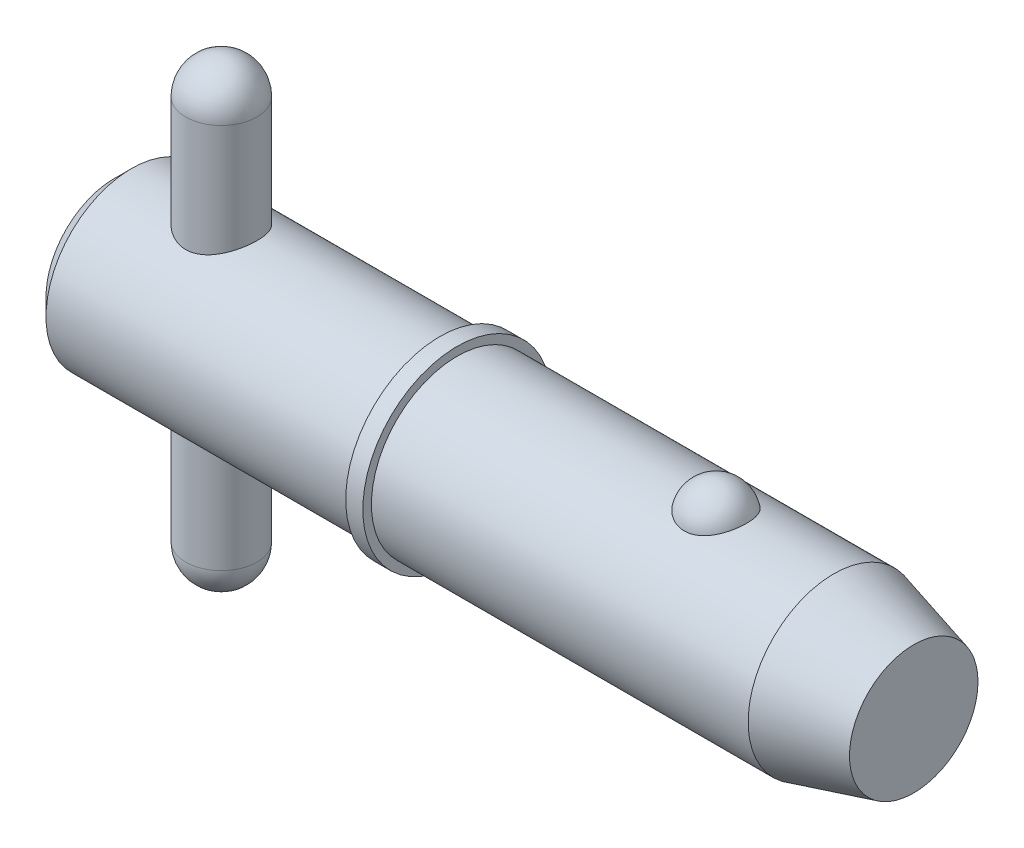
ISO-10303-21;
HEADER;
FILE_DESCRIPTION(('STEP AP214'),'2;1');
FILE_NAME('part.step','',(''),(''),'','','');
FILE_SCHEMA(('AUTOMOTIVE_DESIGN { 1 0 10303 214 1 1 1 1 }'));
ENDSEC;
DATA;
#1=APPLICATION_CONTEXT('core data for automotive mechanical design processes');
#2=APPLICATION_PROTOCOL_DEFINITION('international standard','automotive_design',2000,#1);
#3=PRODUCT_CONTEXT('',#1,'mechanical');
#4=PRODUCT('Part','Part','',(#3));
#5=PRODUCT_RELATED_PRODUCT_CATEGORY('part','',(#4));
#6=PRODUCT_DEFINITION_FORMATION('','',#4);
#7=PRODUCT_DEFINITION_CONTEXT('part definition',#1,'design');
#8=PRODUCT_DEFINITION('design','',#6,#7);
#9=PRODUCT_DEFINITION_SHAPE('','',#8);
#10=(LENGTH_UNIT() NAMED_UNIT(*) SI_UNIT(.MILLI.,.METRE.));
#11=(NAMED_UNIT(*) PLANE_ANGLE_UNIT() SI_UNIT($,.RADIAN.));
#12=(NAMED_UNIT(*) SI_UNIT($,.STERADIAN.) SOLID_ANGLE_UNIT());
#13=UNCERTAINTY_MEASURE_WITH_UNIT(LENGTH_MEASURE(1.E-05),#10,'distance_accuracy_value','');
#14=(GEOMETRIC_REPRESENTATION_CONTEXT(3) GLOBAL_UNCERTAINTY_ASSIGNED_CONTEXT((#13)) GLOBAL_UNIT_ASSIGNED_CONTEXT((#10,
#11,#12)) REPRESENTATION_CONTEXT('',''));
#15=CARTESIAN_POINT('',(0.,0.,0.));
#16=DIRECTION('',(0.,0.,1.));
#17=DIRECTION('',(1.,0.,0.));
#18=AXIS2_PLACEMENT_3D('',#15,#16,#17);
#19=CARTESIAN_POINT('',(5.94,12.7,0.));
#20=DIRECTION('',(0.,-1.,0.));
#21=DIRECTION('',(0.,0.,-1.));
#22=AXIS2_PLACEMENT_3D('',#19,#20,#21);
#23=CYLINDRICAL_SURFACE('',#22,1.98);
#24=CARTESIAN_POINT('',(5.94,-10.72,0.));
#25=DIRECTION('',(0.,-1.,0.));
#26=DIRECTION('',(0.,0.,-1.));
#27=AXIS2_PLACEMENT_3D('',#24,#25,#26);
#28=CIRCLE('',#27,1.98);
#29=CARTESIAN_POINT('',(5.94,-10.72,-1.98));
#30=VERTEX_POINT('',#29);
#31=EDGE_CURVE('P0_E10',#30,#30,#28,.F.);
#32=ORIENTED_EDGE('',*,*,#31,.T.);
#33=EDGE_LOOP('',(#32));
#34=FACE_BOUND('',#33,.T.);
#35=CARTESIAN_POINT('',(5.94,10.72,0.));
#36=DIRECTION('',(0.,-1.,0.));
#37=DIRECTION('',(0.,0.,-1.));
#38=AXIS2_PLACEMENT_3D('',#35,#36,#37);
#39=CIRCLE('',#38,1.98);
#40=CARTESIAN_POINT('',(5.94,10.72,-1.98));
#41=VERTEX_POINT('',#40);
#42=EDGE_CURVE('P0_E21',#41,#41,#39,.T.);
#43=ORIENTED_EDGE('',*,*,#42,.T.);
#44=EDGE_LOOP('',(#43));
#45=FACE_BOUND('',#44,.T.);
#46=ADVANCED_FACE('P0_F14',(#34,#45),#23,.T.);
#47=CARTESIAN_POINT('',(5.94,-10.72,0.));
#48=DIRECTION('',(0.,0.,1.));
#49=DIRECTION('',(1.,0.,0.));
#50=AXIS2_PLACEMENT_3D('',#47,#48,#49);
#51=SPHERICAL_SURFACE('',#50,1.98);
#52=CARTESIAN_POINT('',(5.94,-10.72,0.));
#53=DIRECTION('',(0.,-1.,0.));
#54=DIRECTION('',(0.,0.,-1.));
#55=AXIS2_PLACEMENT_3D('',#52,#53,#54);
#56=SPHERICAL_SURFACE('',#55,1.98);
#57=ORIENTED_EDGE('',*,*,#31,.F.);
#58=EDGE_LOOP('',(#57));
#59=FACE_BOUND('',#58,.T.);
#60=ADVANCED_FACE('P0_F29',(#59),#56,.T.);
#61=CARTESIAN_POINT('',(5.94,10.72,0.));
#62=DIRECTION('',(0.,0.,1.));
#63=DIRECTION('',(1.,0.,0.));
#64=AXIS2_PLACEMENT_3D('',#61,#62,#63);
#65=SPHERICAL_SURFACE('',#64,1.98);
#66=CARTESIAN_POINT('',(5.94,10.72,0.));
#67=DIRECTION('',(0.,-1.,0.));
#68=DIRECTION('',(0.,0.,-1.));
#69=AXIS2_PLACEMENT_3D('',#66,#67,#68);
#70=SPHERICAL_SURFACE('',#69,1.98);
#71=ORIENTED_EDGE('',*,*,#42,.F.);
#72=EDGE_LOOP('',(#71));
#73=FACE_BOUND('',#72,.T.);
#74=ADVANCED_FACE('P0_F16',(#73),#70,.T.);
#75=CLOSED_SHELL('',(#46,#60,#74));
#76=MANIFOLD_SOLID_BREP('P0_B1',#75);
#77=CARTESIAN_POINT('',(0.,0.,0.));
#78=DIRECTION('',(1.,0.,0.));
#79=DIRECTION('',(0.,0.,-1.));
#80=AXIS2_PLACEMENT_3D('',#77,#78,#79);
#81=CYLINDRICAL_SURFACE('',#80,4.765);
#82=CARTESIAN_POINT('',(40.0041944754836,0.,0.));
#83=DIRECTION('',(1.,0.,0.));
#84=DIRECTION('',(0.,0.,-1.));
#85=AXIS2_PLACEMENT_3D('',#82,#83,#84);
#86=CIRCLE('',#85,4.765);
#87=CARTESIAN_POINT('',(40.0041944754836,0.,-4.765));
#88=VERTEX_POINT('',#87);
#89=EDGE_CURVE('P1_E81',#88,#88,#86,.T.);
#90=ORIENTED_EDGE('',*,*,#89,.F.);
#91=EDGE_LOOP('',(#90));
#92=FACE_BOUND('',#91,.T.);
#93=CARTESIAN_POINT('',(19.05,0.,0.));
#94=DIRECTION('',(1.,0.,0.));
#95=DIRECTION('',(0.,0.,-1.));
#96=AXIS2_PLACEMENT_3D('',#93,#94,#95);
#97=CIRCLE('',#96,4.765);
#98=CARTESIAN_POINT('',(19.05,0.,-4.765));
#99=VERTEX_POINT('',#98);
#100=EDGE_CURVE('P1_E85',#99,#99,#97,.T.);
#101=ORIENTED_EDGE('',*,*,#100,.T.);
#102=EDGE_LOOP('',(#101));
#103=FACE_BOUND('',#102,.T.);
#104=CARTESIAN_POINT('',(33.451020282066,4.42764777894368,1.76101111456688));
#105=CARTESIAN_POINT('',(33.3597212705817,4.42764470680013,1.76101422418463));
#106=CARTESIAN_POINT('',(33.2684468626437,4.43059091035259,1.75366340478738));
#107=CARTESIAN_POINT('',(33.0886154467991,4.44201846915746,1.72451180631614));
#108=CARTESIAN_POINT('',(33.0000577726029,4.45049845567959,1.70271460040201));
#109=CARTESIAN_POINT('',(32.8282570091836,4.47200516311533,1.64539370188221));
#110=CARTESIAN_POINT('',(32.7450064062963,4.48502527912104,1.60988994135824));
#111=CARTESIAN_POINT('',(32.5857633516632,4.51419542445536,1.52617873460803));
#112=CARTESIAN_POINT('',(32.5097723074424,4.53034605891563,1.47796883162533));
#113=CARTESIAN_POINT('',(32.3647445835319,4.5645931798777,1.36860494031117));
#114=CARTESIAN_POINT('',(32.2959645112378,4.58273170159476,1.3071242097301));
#115=CARTESIAN_POINT('',(32.1693423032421,4.61870302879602,1.17370204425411));
#116=CARTESIAN_POINT('',(32.1115021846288,4.63653577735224,1.10175868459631));
#117=CARTESIAN_POINT('',(32.0055709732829,4.67090140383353,0.945806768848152));
#118=CARTESIAN_POINT('',(31.9580305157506,4.68734068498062,0.861402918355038));
#119=CARTESIAN_POINT('',(31.8770817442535,4.71628466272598,0.685442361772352));
#120=CARTESIAN_POINT('',(31.8436747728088,4.72878898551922,0.593884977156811));
#121=CARTESIAN_POINT('',(31.791287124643,4.74874061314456,0.404781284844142));
#122=CARTESIAN_POINT('',(31.7725178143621,4.75611366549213,0.307168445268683));
#123=CARTESIAN_POINT('',(31.7505846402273,4.76475393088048,0.109940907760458));
#124=CARTESIAN_POINT('',(31.7474205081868,4.76602124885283,0.0103262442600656));
#125=CARTESIAN_POINT('',(31.7567405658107,4.76232928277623,-0.187629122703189));
#126=CARTESIAN_POINT('',(31.7691588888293,4.7573962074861,-0.285973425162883));
#127=CARTESIAN_POINT('',(31.8092804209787,4.74184975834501,-0.479027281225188));
#128=CARTESIAN_POINT('',(31.8369839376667,4.7312362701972,-0.573736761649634));
#129=CARTESIAN_POINT('',(31.9071581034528,4.70540026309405,-0.756973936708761));
#130=CARTESIAN_POINT('',(31.9496460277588,4.69017235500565,-0.845494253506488));
#131=CARTESIAN_POINT('',(32.048520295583,4.6566986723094,-1.01378033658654));
#132=CARTESIAN_POINT('',(32.1049076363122,4.63845268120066,-1.09354547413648));
#133=CARTESIAN_POINT('',(32.230552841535,4.60085438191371,-1.24228523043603));
#134=CARTESIAN_POINT('',(32.2998439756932,4.58149930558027,-1.31123108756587));
#135=CARTESIAN_POINT('',(32.4496066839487,4.54391653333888,-1.43607409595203));
#136=CARTESIAN_POINT('',(32.5300771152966,4.52568872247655,-1.49197257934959));
#137=CARTESIAN_POINT('',(32.6981500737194,4.49293007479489,-1.58786764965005));
#138=CARTESIAN_POINT('',(32.7855445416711,4.47832346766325,-1.62820219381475));
#139=CARTESIAN_POINT('',(32.966553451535,4.45406011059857,-1.69345757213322));
#140=CARTESIAN_POINT('',(33.0601655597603,4.44440151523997,-1.71838415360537));
#141=CARTESIAN_POINT('',(33.2458939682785,4.43159888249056,-1.75112843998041));
#142=CARTESIAN_POINT('',(33.337849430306,4.42815213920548,-1.75974223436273));
#143=CARTESIAN_POINT('',(33.5219658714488,4.427247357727,-1.76201865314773));
#144=CARTESIAN_POINT('',(33.6141268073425,4.42978816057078,-1.7556841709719));
#145=CARTESIAN_POINT('',(33.7931292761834,4.4403864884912,-1.72869560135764));
#146=CARTESIAN_POINT('',(33.8800474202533,4.44827555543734,-1.70847853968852));
#147=CARTESIAN_POINT('',(34.0491314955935,4.46852246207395,-1.65479562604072));
#148=CARTESIAN_POINT('',(34.1312970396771,4.48088066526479,-1.62132869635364));
#149=CARTESIAN_POINT('',(34.2905916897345,4.50907357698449,-1.54120560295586));
#150=CARTESIAN_POINT('',(34.3675700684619,4.52497884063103,-1.49427526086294));
#151=CARTESIAN_POINT('',(34.5127080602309,4.55845148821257,-1.38881222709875));
#152=CARTESIAN_POINT('',(34.5808656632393,4.57601924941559,-1.33027689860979));
#153=CARTESIAN_POINT('',(34.7100990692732,4.61196537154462,-1.19991049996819));
#154=CARTESIAN_POINT('',(34.7706562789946,4.63034074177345,-1.12756415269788));
#155=CARTESIAN_POINT('',(34.8792797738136,4.66513959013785,-0.973612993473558));
#156=CARTESIAN_POINT('',(34.9273438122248,4.68156271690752,-0.892006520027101));
#157=CARTESIAN_POINT('',(35.011383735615,4.71130224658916,-0.718892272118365));
#158=CARTESIAN_POINT('',(35.0469185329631,4.724501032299,-0.627149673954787));
#159=CARTESIAN_POINT('',(35.1029522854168,4.74571823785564,-0.438611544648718));
#160=CARTESIAN_POINT('',(35.123450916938,4.75373654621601,-0.341815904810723));
#161=CARTESIAN_POINT('',(35.1490338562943,4.76378905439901,-0.145633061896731));
#162=CARTESIAN_POINT('',(35.154076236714,4.76580697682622,-0.046239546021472));
#163=CARTESIAN_POINT('',(35.1485239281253,4.76360573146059,0.15203857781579));
#164=CARTESIAN_POINT('',(35.1379294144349,4.75938663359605,0.250923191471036));
#165=CARTESIAN_POINT('',(35.1013875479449,4.74516937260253,0.445004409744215));
#166=CARTESIAN_POINT('',(35.0754964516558,4.73519238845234,0.540213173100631));
#167=CARTESIAN_POINT('',(35.0089273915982,4.7104939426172,0.724662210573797));
#168=CARTESIAN_POINT('',(34.968248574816,4.69577220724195,0.81390214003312));
#169=CARTESIAN_POINT('',(34.8727177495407,4.66303767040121,0.984313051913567));
#170=CARTESIAN_POINT('',(34.8178042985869,4.64501070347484,1.06544688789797));
#171=CARTESIAN_POINT('',(34.6950496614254,4.60764678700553,1.21692673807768));
#172=CARTESIAN_POINT('',(34.6272086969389,4.58830985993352,1.2872729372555));
#173=CARTESIAN_POINT('',(34.4805480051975,4.55060370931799,1.41479271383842));
#174=CARTESIAN_POINT('',(34.4017918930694,4.53222967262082,1.47203785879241));
#175=CARTESIAN_POINT('',(34.2349890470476,4.49849576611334,1.57212016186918));
#176=CARTESIAN_POINT('',(34.1469417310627,4.48313608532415,1.61495641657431));
#177=CARTESIAN_POINT('',(33.9597918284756,4.45676184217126,1.68642657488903));
#178=CARTESIAN_POINT('',(33.8603653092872,4.44598302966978,1.71430590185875));
#179=CARTESIAN_POINT('',(33.6576210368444,4.43142918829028,1.7515925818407));
#180=CARTESIAN_POINT('',(33.5543049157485,4.42765125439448,1.76100759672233));
#181=CARTESIAN_POINT('',(33.451020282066,4.42764777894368,1.76101111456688));
#182=B_SPLINE_CURVE_WITH_KNOTS('',3,(#104,#105,#106,#107,#108,#109,#110,#111,#112,#113,#114,
#115,#116,#117,#118,#119,#120,#121,#122,#123,#124,#125,#126,#127,#128,#129,#130,#131,#132,#133,
#134,#135,#136,#137,#138,#139,#140,#141,#142,#143,#144,#145,#146,#147,#148,#149,#150,#151,#152,
#153,#154,#155,#156,#157,#158,#159,#160,#161,#162,#163,#164,#165,#166,#167,#168,#169,#170,#171,
#172,#173,#174,#175,#176,#177,#178,#179,#180,#181),.UNSPECIFIED.,.T.,.F.,(4,2,2,2,2,2,2,2,2,2,2,
2,2,2,2,2,2,2,2,2,2,2,2,2,2,2,2,2,2,2,2,2,2,2,2,2,2,2,4),(0.,0.273517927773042,
0.546968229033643,0.820022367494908,1.09312934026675,1.37393946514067,1.65480131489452,
1.94820420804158,2.24163496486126,2.53922817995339,2.8368162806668,3.13315071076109,
3.42949110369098,3.72617893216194,4.02288805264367,4.32037303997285,4.61782764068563,
4.90840095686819,5.19886582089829,5.47474855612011,5.75057789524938,6.01809977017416,
6.28564340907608,6.55907787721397,6.83257454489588,7.11962987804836,7.40673679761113,
7.70312663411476,7.99952284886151,8.29672237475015,8.59391856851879,8.89002850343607,
9.18615552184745,9.483582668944,9.78100471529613,10.0767610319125,10.3725358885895,
10.6820893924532,10.991514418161),.UNSPECIFIED.);
#183=CARTESIAN_POINT('',(33.451020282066,4.42764777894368,1.76101111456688));
#184=VERTEX_POINT('',#183);
#185=EDGE_CURVE('P1_E35',#184,#184,#182,.T.);
#186=ORIENTED_EDGE('',*,*,#185,.T.);
#187=EDGE_LOOP('',(#186));
#188=FACE_BOUND('',#187,.T.);
#189=ADVANCED_FACE('P1_F13',(#92,#103,#188),#81,.T.);
#190=CARTESIAN_POINT('',(0.,0.,0.));
#191=DIRECTION('',(-1.,0.,0.));
#192=DIRECTION('',(0.,0.,1.));
#193=AXIS2_PLACEMENT_3D('',#190,#191,#192);
#194=PLANE('',#193);
#195=CARTESIAN_POINT('',(0.,0.,0.));
#196=DIRECTION('',(1.,0.,0.));
#197=DIRECTION('',(0.,0.,-1.));
#198=AXIS2_PLACEMENT_3D('',#195,#196,#197);
#199=CIRCLE('',#198,3.812);
#200=CARTESIAN_POINT('',(0.,0.,-3.812));
#201=VERTEX_POINT('',#200);
#202=EDGE_CURVE('P1_E9',#201,#201,#199,.T.);
#203=ORIENTED_EDGE('',*,*,#202,.F.);
#204=EDGE_LOOP('',(#203));
#205=FACE_BOUND('',#204,.T.);
#206=ADVANCED_FACE('P1_F15',(#205),#194,.T.);
#207=CARTESIAN_POINT('',(0.952999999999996,0.,0.));
#208=DIRECTION('',(1.,0.,0.));
#209=DIRECTION('',(0.,0.,-1.));
#210=AXIS2_PLACEMENT_3D('',#207,#208,#209);
#211=CONICAL_SURFACE('',#210,4.765,0.78539816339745);
#212=ORIENTED_EDGE('',*,*,#202,.T.);
#213=EDGE_LOOP('',(#212));
#214=FACE_BOUND('',#213,.T.);
#215=CARTESIAN_POINT('',(0.952999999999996,0.,0.));
#216=DIRECTION('',(1.,0.,0.));
#217=DIRECTION('',(0.,0.,-1.));
#218=AXIS2_PLACEMENT_3D('',#215,#216,#217);
#219=CIRCLE('',#218,4.765);
#220=CARTESIAN_POINT('',(0.952999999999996,0.,-4.765));
#221=VERTEX_POINT('',#220);
#222=EDGE_CURVE('P1_E26',#221,#221,#219,.T.);
#223=ORIENTED_EDGE('',*,*,#222,.F.);
#224=EDGE_LOOP('',(#223));
#225=FACE_BOUND('',#224,.T.);
#226=ADVANCED_FACE('P1_F77',(#214,#225),#211,.T.);
#227=CARTESIAN_POINT('',(0.,0.,0.));
#228=DIRECTION('',(1.,0.,0.));
#229=DIRECTION('',(0.,0.,-1.));
#230=AXIS2_PLACEMENT_3D('',#227,#228,#229);
#231=CYLINDRICAL_SURFACE('',#230,4.765);
#232=CARTESIAN_POINT('',(5.94,-4.33414639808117,1.98));
#233=CARTESIAN_POINT('',(5.83435484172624,-4.33415447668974,1.97999169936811));
#234=CARTESIAN_POINT('',(5.72854887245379,-4.33806396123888,1.97149330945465));
#235=CARTESIAN_POINT('',(5.51998191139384,-4.35319906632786,1.93783487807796));
#236=CARTESIAN_POINT('',(5.41723000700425,-4.3644446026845,1.91262947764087));
#237=CARTESIAN_POINT('',(5.21817294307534,-4.39274225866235,1.84670269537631));
#238=CARTESIAN_POINT('',(5.12184344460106,-4.40977076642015,1.80604432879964));
#239=CARTESIAN_POINT('',(4.93740039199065,-4.44768106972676,1.71055160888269));
#240=CARTESIAN_POINT('',(4.84928487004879,-4.46856193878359,1.65572066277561));
#241=CARTESIAN_POINT('',(4.67826533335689,-4.51326966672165,1.52981120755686));
#242=CARTESIAN_POINT('',(4.59593118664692,-4.53719608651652,1.45799365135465));
#243=CARTESIAN_POINT('',(4.44405452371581,-4.58448035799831,1.30170177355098));
#244=CARTESIAN_POINT('',(4.37451692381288,-4.60783798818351,1.21722260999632));
#245=CARTESIAN_POINT('',(4.24730683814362,-4.65256187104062,1.03353484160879));
#246=CARTESIAN_POINT('',(4.19027484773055,-4.67379892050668,0.933848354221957));
#247=CARTESIAN_POINT('',(4.0940363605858,-4.7106711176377,0.7252544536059));
#248=CARTESIAN_POINT('',(4.05482199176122,-4.72630873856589,0.61635113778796));
#249=CARTESIAN_POINT('',(3.99739515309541,-4.74951416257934,0.398397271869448));
#250=CARTESIAN_POINT('',(3.97820018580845,-4.7574579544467,0.289646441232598));
#251=CARTESIAN_POINT('',(3.95818309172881,-4.76574596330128,0.0701967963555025));
#252=CARTESIAN_POINT('',(3.95735355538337,-4.76609324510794,-0.0405012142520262));
#253=CARTESIAN_POINT('',(3.9735743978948,-4.75937098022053,-0.253561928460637));
#254=CARTESIAN_POINT('',(3.98954548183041,-4.75274912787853,-0.356023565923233));
#255=CARTESIAN_POINT('',(4.03706504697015,-4.73344665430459,-0.556659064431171));
#256=CARTESIAN_POINT('',(4.06861467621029,-4.72076558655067,-0.654832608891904));
#257=CARTESIAN_POINT('',(4.14677192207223,-4.69032846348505,-0.845904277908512));
#258=CARTESIAN_POINT('',(4.19360181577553,-4.67249797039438,-0.938699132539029));
#259=CARTESIAN_POINT('',(4.30077315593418,-4.63350852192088,-1.11535616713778));
#260=CARTESIAN_POINT('',(4.3611193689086,-4.61234839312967,-1.19921518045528));
#261=CARTESIAN_POINT('',(4.49853487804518,-4.56707259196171,-1.3618711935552));
#262=CARTESIAN_POINT('',(4.57648039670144,-4.5428537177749,-1.43990029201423));
#263=CARTESIAN_POINT('',(4.74440779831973,-4.49530722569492,-1.58211009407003));
#264=CARTESIAN_POINT('',(4.83439425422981,-4.47197995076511,-1.64628551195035));
#265=CARTESIAN_POINT('',(5.02755026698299,-4.42812342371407,-1.76092221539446));
#266=CARTESIAN_POINT('',(5.13105348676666,-4.40770990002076,-1.81086937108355));
#267=CARTESIAN_POINT('',(5.34607555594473,-4.37336901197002,-1.89231211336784));
#268=CARTESIAN_POINT('',(5.45758864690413,-4.3594370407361,-1.92382080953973));
#269=CARTESIAN_POINT('',(5.67777275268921,-4.34077746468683,-1.96554536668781));
#270=CARTESIAN_POINT('',(5.78616167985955,-4.33551319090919,-1.9770057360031));
#271=CARTESIAN_POINT('',(6.00341835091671,-4.33325118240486,-1.98196183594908));
#272=CARTESIAN_POINT('',(6.11228591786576,-4.33625061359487,-1.97546372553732));
#273=CARTESIAN_POINT('',(6.32012423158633,-4.34962383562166,-1.94582288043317));
#274=CARTESIAN_POINT('',(6.41928436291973,-4.35951709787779,-1.92376364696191));
#275=CARTESIAN_POINT('',(6.61241543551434,-4.38495043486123,-1.86506038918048));
#276=CARTESIAN_POINT('',(6.70638516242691,-4.40049182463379,-1.82841296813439));
#277=CARTESIAN_POINT('',(6.89090272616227,-4.43627016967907,-1.73985559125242));
#278=CARTESIAN_POINT('',(6.98113841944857,-4.45667771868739,-1.68736639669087));
#279=CARTESIAN_POINT('',(7.1519532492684,-4.49964530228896,-1.56919282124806));
#280=CARTESIAN_POINT('',(7.232528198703,-4.52220626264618,-1.50350275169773));
#281=CARTESIAN_POINT('',(7.38851617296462,-4.56914071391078,-1.35452895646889));
#282=CARTESIAN_POINT('',(7.46298462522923,-4.5935132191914,-1.27025197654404));
#283=CARTESIAN_POINT('',(7.59689029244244,-4.63962841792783,-1.08983181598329));
#284=CARTESIAN_POINT('',(7.65632644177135,-4.66137092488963,-0.993687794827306));
#285=CARTESIAN_POINT('',(7.75840361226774,-4.69991192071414,-0.791608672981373));
#286=CARTESIAN_POINT('',(7.80100481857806,-4.71669866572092,-0.685651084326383));
#287=CARTESIAN_POINT('',(7.86746997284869,-4.74331408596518,-0.467197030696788));
#288=CARTESIAN_POINT('',(7.8913450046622,-4.75314687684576,-0.354704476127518));
#289=CARTESIAN_POINT('',(7.91828971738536,-4.76427543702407,-0.134819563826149));
#290=CARTESIAN_POINT('',(7.92269147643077,-4.76611762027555,-0.027616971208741));
#291=CARTESIAN_POINT('',(7.91414154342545,-4.76256684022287,0.185959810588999));
#292=CARTESIAN_POINT('',(7.90119286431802,-4.75717513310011,0.292334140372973));
#293=CARTESIAN_POINT('',(7.85926572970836,-4.74004856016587,0.497383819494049));
#294=CARTESIAN_POINT('',(7.83086647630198,-4.72854322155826,0.596198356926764));
#295=CARTESIAN_POINT('',(7.75947503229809,-4.70045111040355,0.787624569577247));
#296=CARTESIAN_POINT('',(7.71648006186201,-4.68386336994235,0.880235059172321));
#297=CARTESIAN_POINT('',(7.6149456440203,-4.64628321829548,1.06122875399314));
#298=CARTESIAN_POINT('',(7.55579211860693,-4.62512577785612,1.14923242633));
#299=CARTESIAN_POINT('',(7.42451813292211,-4.58091700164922,1.31443888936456));
#300=CARTESIAN_POINT('',(7.35239289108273,-4.5578649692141,1.39163767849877));
#301=CARTESIAN_POINT('',(7.19146107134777,-4.51050832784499,1.53847013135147));
#302=CARTESIAN_POINT('',(7.10185635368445,-4.48622440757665,1.60723941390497));
#303=CARTESIAN_POINT('',(6.91164948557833,-4.44076541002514,1.72888900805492));
#304=CARTESIAN_POINT('',(6.81104124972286,-4.41959206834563,1.78176046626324));
#305=CARTESIAN_POINT('',(6.60181953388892,-4.38318936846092,1.86953227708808));
#306=CARTESIAN_POINT('',(6.49325511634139,-4.3679267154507,1.90453365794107));
#307=CARTESIAN_POINT('',(6.32681512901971,-4.35102038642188,1.94268459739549));
#308=CARTESIAN_POINT('',(6.27079191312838,-4.34638447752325,1.953006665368));
#309=CARTESIAN_POINT('',(6.15793999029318,-4.33925923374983,1.96879053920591));
#310=CARTESIAN_POINT('',(6.10111188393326,-4.33676837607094,1.97425579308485));
#311=CARTESIAN_POINT('',(6.00947316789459,-4.33456308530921,1.97908711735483));
#312=CARTESIAN_POINT('',(5.97474528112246,-4.33414374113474,1.98000272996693));
#313=CARTESIAN_POINT('',(5.94,-4.33414639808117,1.98));
#314=B_SPLINE_CURVE_WITH_KNOTS('',3,(#232,#233,#234,#235,#236,#237,#238,#239,#240,#241,#242,
#243,#244,#245,#246,#247,#248,#249,#250,#251,#252,#253,#254,#255,#256,#257,#258,#259,#260,#261,
#262,#263,#264,#265,#266,#267,#268,#269,#270,#271,#272,#273,#274,#275,#276,#277,#278,#279,#280,
#281,#282,#283,#284,#285,#286,#287,#288,#289,#290,#291,#292,#293,#294,#295,#296,#297,#298,#299,
#300,#301,#302,#303,#304,#305,#306,#307,#308,#309,#310,#311,#312,#313),.UNSPECIFIED.,.T.,.F.,(4,
2,2,2,2,2,2,2,2,2,2,2,2,2,2,2,2,2,2,2,2,2,2,2,2,2,2,2,2,2,2,2,2,2,2,2,2,2,2,2,4),(0.,
0.316814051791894,0.634491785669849,0.950887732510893,1.2672076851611,1.60127705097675,
1.93547449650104,2.28407463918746,2.63252061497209,2.96292077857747,3.29318763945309,
3.60346227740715,3.91375978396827,4.22878888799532,4.54392926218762,4.88117914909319,
5.21855748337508,5.56691259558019,5.91501972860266,6.24062939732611,6.56612741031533,
6.87094948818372,7.17584258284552,7.49361276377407,7.81152017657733,8.15513975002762,
8.4987836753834,8.8432355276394,9.18748334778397,9.50777781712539,9.8280166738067,
10.1370037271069,10.4460496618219,10.7690461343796,11.0921619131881,11.4371238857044,
11.7822776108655,12.1254577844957,12.2967183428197,12.4678572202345,12.5720531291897),.UNSPECIFIED.);
#315=CARTESIAN_POINT('',(5.94,-4.33414639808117,1.98));
#316=VERTEX_POINT('',#315);
#317=EDGE_CURVE('P1_E17',#316,#316,#314,.T.);
#318=ORIENTED_EDGE('',*,*,#317,.F.);
#319=EDGE_LOOP('',(#318));
#320=FACE_BOUND('',#319,.T.);
#321=CARTESIAN_POINT('',(5.94,4.33414639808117,1.98));
#322=CARTESIAN_POINT('',(6.04564515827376,4.33415447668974,1.97999169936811));
#323=CARTESIAN_POINT('',(6.15145112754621,4.33806396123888,1.97149330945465));
#324=CARTESIAN_POINT('',(6.36001808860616,4.35319906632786,1.93783487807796));
#325=CARTESIAN_POINT('',(6.46276999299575,4.3644446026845,1.91262947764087));
#326=CARTESIAN_POINT('',(6.66182705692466,4.39274225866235,1.84670269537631));
#327=CARTESIAN_POINT('',(6.75815655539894,4.40977076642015,1.80604432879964));
#328=CARTESIAN_POINT('',(6.94259960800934,4.44768106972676,1.71055160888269));
#329=CARTESIAN_POINT('',(7.03071512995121,4.46856193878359,1.65572066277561));
#330=CARTESIAN_POINT('',(7.20173466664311,4.51326966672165,1.52981120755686));
#331=CARTESIAN_POINT('',(7.28406881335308,4.53719608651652,1.45799365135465));
#332=CARTESIAN_POINT('',(7.43594547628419,4.58448035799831,1.30170177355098));
#333=CARTESIAN_POINT('',(7.50548307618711,4.60783798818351,1.21722260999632));
#334=CARTESIAN_POINT('',(7.63269316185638,4.65256187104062,1.03353484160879));
#335=CARTESIAN_POINT('',(7.68972515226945,4.67379892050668,0.933848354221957));
#336=CARTESIAN_POINT('',(7.7859636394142,4.7106711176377,0.7252544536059));
#337=CARTESIAN_POINT('',(7.82517800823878,4.72630873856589,0.61635113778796));
#338=CARTESIAN_POINT('',(7.88260484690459,4.74951416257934,0.398397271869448));
#339=CARTESIAN_POINT('',(7.90179981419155,4.7574579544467,0.289646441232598));
#340=CARTESIAN_POINT('',(7.92181690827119,4.76574596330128,0.0701967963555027));
#341=CARTESIAN_POINT('',(7.92264644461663,4.76609324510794,-0.040501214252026));
#342=CARTESIAN_POINT('',(7.9064256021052,4.75937098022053,-0.253561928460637));
#343=CARTESIAN_POINT('',(7.89045451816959,4.75274912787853,-0.356023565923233));
#344=CARTESIAN_POINT('',(7.84293495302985,4.73344665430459,-0.55665906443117));
#345=CARTESIAN_POINT('',(7.81138532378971,4.72076558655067,-0.654832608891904));
#346=CARTESIAN_POINT('',(7.73322807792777,4.69032846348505,-0.845904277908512));
#347=CARTESIAN_POINT('',(7.68639818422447,4.67249797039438,-0.938699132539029));
#348=CARTESIAN_POINT('',(7.57922684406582,4.63350852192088,-1.11535616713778));
#349=CARTESIAN_POINT('',(7.5188806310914,4.61234839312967,-1.19921518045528));
#350=CARTESIAN_POINT('',(7.38146512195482,4.56707259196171,-1.3618711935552));
#351=CARTESIAN_POINT('',(7.30351960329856,4.5428537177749,-1.43990029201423));
#352=CARTESIAN_POINT('',(7.13559220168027,4.49530722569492,-1.58211009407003));
#353=CARTESIAN_POINT('',(7.04560574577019,4.47197995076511,-1.64628551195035));
#354=CARTESIAN_POINT('',(6.85244973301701,4.42812342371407,-1.76092221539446));
#355=CARTESIAN_POINT('',(6.74894651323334,4.40770990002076,-1.81086937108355));
#356=CARTESIAN_POINT('',(6.53392444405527,4.37336901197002,-1.89231211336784));
#357=CARTESIAN_POINT('',(6.42241135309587,4.3594370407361,-1.92382080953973));
#358=CARTESIAN_POINT('',(6.20222724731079,4.34077746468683,-1.96554536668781));
#359=CARTESIAN_POINT('',(6.09383832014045,4.33551319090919,-1.9770057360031));
#360=CARTESIAN_POINT('',(5.87658164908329,4.33325118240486,-1.98196183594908));
#361=CARTESIAN_POINT('',(5.76771408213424,4.33625061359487,-1.97546372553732));
#362=CARTESIAN_POINT('',(5.55987576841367,4.34962383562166,-1.94582288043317));
#363=CARTESIAN_POINT('',(5.46071563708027,4.35951709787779,-1.92376364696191));
#364=CARTESIAN_POINT('',(5.26758456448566,4.38495043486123,-1.86506038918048));
#365=CARTESIAN_POINT('',(5.17361483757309,4.40049182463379,-1.82841296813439));
#366=CARTESIAN_POINT('',(4.98909727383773,4.43627016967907,-1.73985559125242));
#367=CARTESIAN_POINT('',(4.89886158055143,4.45667771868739,-1.68736639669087));
#368=CARTESIAN_POINT('',(4.72804675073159,4.49964530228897,-1.56919282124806));
#369=CARTESIAN_POINT('',(4.647471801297,4.52220626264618,-1.50350275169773));
#370=CARTESIAN_POINT('',(4.49148382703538,4.56914071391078,-1.35452895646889));
#371=CARTESIAN_POINT('',(4.41701537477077,4.5935132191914,-1.27025197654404));
#372=CARTESIAN_POINT('',(4.28310970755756,4.63962841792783,-1.08983181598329));
#373=CARTESIAN_POINT('',(4.22367355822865,4.66137092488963,-0.993687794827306));
#374=CARTESIAN_POINT('',(4.12159638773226,4.69991192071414,-0.791608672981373));
#375=CARTESIAN_POINT('',(4.07899518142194,4.71669866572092,-0.685651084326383));
#376=CARTESIAN_POINT('',(4.01253002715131,4.74331408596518,-0.467197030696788));
#377=CARTESIAN_POINT('',(3.98865499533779,4.75314687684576,-0.354704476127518));
#378=CARTESIAN_POINT('',(3.96171028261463,4.76427543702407,-0.134819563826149));
#379=CARTESIAN_POINT('',(3.95730852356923,4.76611762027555,-0.0276169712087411));
#380=CARTESIAN_POINT('',(3.96585845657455,4.76256684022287,0.185959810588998));
#381=CARTESIAN_POINT('',(3.97880713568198,4.75717513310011,0.292334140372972));
#382=CARTESIAN_POINT('',(4.02073427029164,4.74004856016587,0.497383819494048));
#383=CARTESIAN_POINT('',(4.04913352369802,4.72854322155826,0.596198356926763));
#384=CARTESIAN_POINT('',(4.12052496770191,4.70045111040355,0.787624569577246));
#385=CARTESIAN_POINT('',(4.16351993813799,4.68386336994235,0.880235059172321));
#386=CARTESIAN_POINT('',(4.2650543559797,4.64628321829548,1.06122875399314));
#387=CARTESIAN_POINT('',(4.32420788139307,4.62512577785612,1.14923242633));
#388=CARTESIAN_POINT('',(4.45548186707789,4.58091700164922,1.31443888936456));
#389=CARTESIAN_POINT('',(4.52760710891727,4.5578649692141,1.39163767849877));
#390=CARTESIAN_POINT('',(4.68853892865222,4.51050832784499,1.53847013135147));
#391=CARTESIAN_POINT('',(4.77814364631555,4.48622440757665,1.60723941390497));
#392=CARTESIAN_POINT('',(4.96835051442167,4.44076541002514,1.72888900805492));
#393=CARTESIAN_POINT('',(5.06895875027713,4.41959206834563,1.78176046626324));
#394=CARTESIAN_POINT('',(5.27818046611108,4.38318936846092,1.86953227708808));
#395=CARTESIAN_POINT('',(5.38674488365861,4.3679267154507,1.90453365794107));
#396=CARTESIAN_POINT('',(5.55318487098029,4.35102038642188,1.94268459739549));
#397=CARTESIAN_POINT('',(5.60920808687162,4.34638447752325,1.953006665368));
#398=CARTESIAN_POINT('',(5.72206000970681,4.33925923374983,1.96879053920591));
#399=CARTESIAN_POINT('',(5.77888811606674,4.33676837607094,1.97425579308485));
#400=CARTESIAN_POINT('',(5.87052683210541,4.33456308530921,1.97908711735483));
#401=CARTESIAN_POINT('',(5.90525471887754,4.33414374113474,1.98000272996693));
#402=CARTESIAN_POINT('',(5.94,4.33414639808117,1.98));
#403=B_SPLINE_CURVE_WITH_KNOTS('',3,(#321,#322,#323,#324,#325,#326,#327,#328,#329,#330,#331,
#332,#333,#334,#335,#336,#337,#338,#339,#340,#341,#342,#343,#344,#345,#346,#347,#348,#349,#350,
#351,#352,#353,#354,#355,#356,#357,#358,#359,#360,#361,#362,#363,#364,#365,#366,#367,#368,#369,
#370,#371,#372,#373,#374,#375,#376,#377,#378,#379,#380,#381,#382,#383,#384,#385,#386,#387,#388,
#389,#390,#391,#392,#393,#394,#395,#396,#397,#398,#399,#400,#401,#402),.UNSPECIFIED.,.T.,.F.,(4,
2,2,2,2,2,2,2,2,2,2,2,2,2,2,2,2,2,2,2,2,2,2,2,2,2,2,2,2,2,2,2,2,2,2,2,2,2,2,2,4),(0.,
0.316814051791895,0.634491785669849,0.950887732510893,1.2672076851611,1.60127705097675,
1.93547449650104,2.28407463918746,2.63252061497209,2.96292077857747,3.29318763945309,
3.60346227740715,3.91375978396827,4.22878888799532,4.54392926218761,4.88117914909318,
5.21855748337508,5.56691259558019,5.91501972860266,6.24062939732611,6.56612741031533,
6.87094948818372,7.17584258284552,7.49361276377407,7.81152017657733,8.15513975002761,
8.4987836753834,8.84323552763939,9.18748334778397,9.50777781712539,9.8280166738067,
10.1370037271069,10.4460496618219,10.7690461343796,11.0921619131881,11.4371238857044,
11.7822776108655,12.1254577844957,12.2967183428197,12.4678572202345,12.5720531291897),.UNSPECIFIED.);
#404=CARTESIAN_POINT('',(5.94,4.33414639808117,1.98));
#405=VERTEX_POINT('',#404);
#406=EDGE_CURVE('P1_E43',#405,#405,#403,.T.);
#407=ORIENTED_EDGE('',*,*,#406,.F.);
#408=EDGE_LOOP('',(#407));
#409=FACE_BOUND('',#408,.T.);
#410=ORIENTED_EDGE('',*,*,#222,.T.);
#411=EDGE_LOOP('',(#410));
#412=FACE_BOUND('',#411,.T.);
#413=CARTESIAN_POINT('',(18.097,0.,0.));
#414=DIRECTION('',(1.,0.,0.));
#415=DIRECTION('',(0.,0.,-1.));
#416=AXIS2_PLACEMENT_3D('',#413,#414,#415);
#417=CIRCLE('',#416,4.765);
#418=CARTESIAN_POINT('',(18.097,0.,-4.765));
#419=VERTEX_POINT('',#418);
#420=EDGE_CURVE('P1_E31',#419,#419,#417,.T.);
#421=ORIENTED_EDGE('',*,*,#420,.F.);
#422=EDGE_LOOP('',(#421));
#423=FACE_BOUND('',#422,.T.);
#424=ADVANCED_FACE('P1_F103',(#320,#409,#412,#423),#231,.T.);
#425=CARTESIAN_POINT('',(18.097,4.765,0.));
#426=DIRECTION('',(-1.,0.,0.));
#427=DIRECTION('',(0.,0.,1.));
#428=AXIS2_PLACEMENT_3D('',#425,#426,#427);
#429=PLANE('',#428);
#430=ORIENTED_EDGE('',*,*,#420,.T.);
#431=EDGE_LOOP('',(#430));
#432=FACE_BOUND('',#431,.T.);
#433=CARTESIAN_POINT('',(18.097,0.,0.));
#434=DIRECTION('',(1.,0.,0.));
#435=DIRECTION('',(0.,0.,-1.));
#436=AXIS2_PLACEMENT_3D('',#433,#434,#435);
#437=CIRCLE('',#436,5.2415);
#438=CARTESIAN_POINT('',(18.097,0.,-5.2415));
#439=VERTEX_POINT('',#438);
#440=EDGE_CURVE('P1_E91',#439,#439,#437,.T.);
#441=ORIENTED_EDGE('',*,*,#440,.F.);
#442=EDGE_LOOP('',(#441));
#443=FACE_BOUND('',#442,.T.);
#444=ADVANCED_FACE('P1_F100',(#432,#443),#429,.T.);
#445=CARTESIAN_POINT('',(0.,0.,0.));
#446=DIRECTION('',(1.,0.,0.));
#447=DIRECTION('',(0.,0.,-1.));
#448=AXIS2_PLACEMENT_3D('',#445,#446,#447);
#449=CYLINDRICAL_SURFACE('',#448,5.2415);
#450=ORIENTED_EDGE('',*,*,#440,.T.);
#451=EDGE_LOOP('',(#450));
#452=FACE_BOUND('',#451,.T.);
#453=CARTESIAN_POINT('',(19.05,0.,0.));
#454=DIRECTION('',(1.,0.,0.));
#455=DIRECTION('',(0.,0.,-1.));
#456=AXIS2_PLACEMENT_3D('',#453,#454,#455);
#457=CIRCLE('',#456,5.2415);
#458=CARTESIAN_POINT('',(19.05,0.,-5.2415));
#459=VERTEX_POINT('',#458);
#460=EDGE_CURVE('P1_E88',#459,#459,#457,.T.);
#461=ORIENTED_EDGE('',*,*,#460,.F.);
#462=EDGE_LOOP('',(#461));
#463=FACE_BOUND('',#462,.T.);
#464=ADVANCED_FACE('P1_F68',(#452,#463),#449,.T.);
#465=CARTESIAN_POINT('',(19.05,5.2415,0.));
#466=DIRECTION('',(1.,0.,0.));
#467=DIRECTION('',(0.,0.,-1.));
#468=AXIS2_PLACEMENT_3D('',#465,#466,#467);
#469=PLANE('',#468);
#470=ORIENTED_EDGE('',*,*,#460,.T.);
#471=EDGE_LOOP('',(#470));
#472=FACE_BOUND('',#471,.T.);
#473=ORIENTED_EDGE('',*,*,#100,.F.);
#474=EDGE_LOOP('',(#473));
#475=FACE_BOUND('',#474,.T.);
#476=ADVANCED_FACE('P1_F62',(#472,#475),#469,.T.);
#477=CARTESIAN_POINT('',(44.45,0.,0.));
#478=DIRECTION('',(-1.,0.,0.));
#479=DIRECTION('',(0.,0.,1.));
#480=AXIS2_PLACEMENT_3D('',#477,#478,#479);
#481=CONICAL_SURFACE('',#480,3.57375000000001,0.26179938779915);
#482=ORIENTED_EDGE('',*,*,#89,.T.);
#483=EDGE_LOOP('',(#482));
#484=FACE_BOUND('',#483,.T.);
#485=CARTESIAN_POINT('',(44.45,0.,0.));
#486=DIRECTION('',(1.,0.,0.));
#487=DIRECTION('',(0.,0.,-1.));
#488=AXIS2_PLACEMENT_3D('',#485,#486,#487);
#489=CIRCLE('',#488,3.57375000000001);
#490=CARTESIAN_POINT('',(44.45,0.,-3.57375000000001));
#491=VERTEX_POINT('',#490);
#492=EDGE_CURVE('P1_E42',#491,#491,#489,.T.);
#493=ORIENTED_EDGE('',*,*,#492,.F.);
#494=EDGE_LOOP('',(#493));
#495=FACE_BOUND('',#494,.T.);
#496=ADVANCED_FACE('P1_F59',(#484,#495),#481,.T.);
#497=CARTESIAN_POINT('',(44.45,3.57375000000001,0.));
#498=DIRECTION('',(1.,0.,0.));
#499=DIRECTION('',(0.,0.,-1.));
#500=AXIS2_PLACEMENT_3D('',#497,#498,#499);
#501=PLANE('',#500);
#502=ORIENTED_EDGE('',*,*,#492,.T.);
#503=EDGE_LOOP('',(#502));
#504=FACE_BOUND('',#503,.T.);
#505=ADVANCED_FACE('P1_F55',(#504),#501,.T.);
#506=CARTESIAN_POINT('',(33.451020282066,4.2885,0.));
#507=DIRECTION('',(-1.,0.,0.));
#508=DIRECTION('',(0.,1.,0.));
#509=AXIS2_PLACEMENT_3D('',#506,#507,#508);
#510=SPHERICAL_SURFACE('',#509,1.7665);
#511=ORIENTED_EDGE('',*,*,#185,.F.);
#512=EDGE_LOOP('',(#511));
#513=FACE_BOUND('',#512,.T.);
#514=ADVANCED_FACE('P1_F50',(#513),#510,.T.);
#515=CARTESIAN_POINT('',(5.94,-5.2415,0.));
#516=DIRECTION('',(0.,1.,0.));
#517=DIRECTION('',(0.,0.,1.));
#518=AXIS2_PLACEMENT_3D('',#515,#516,#517);
#519=CYLINDRICAL_SURFACE('',#518,1.98);
#520=ORIENTED_EDGE('',*,*,#317,.T.);
#521=EDGE_LOOP('',(#520));
#522=FACE_BOUND('',#521,.T.);
#523=ORIENTED_EDGE('',*,*,#406,.T.);
#524=EDGE_LOOP('',(#523));
#525=FACE_BOUND('',#524,.T.);
#526=ADVANCED_FACE('P1_F54',(#522,#525),#519,.F.);
#527=CLOSED_SHELL('',(#189,#206,#226,#424,#444,#464,#476,#496,#505,#514,#526));
#528=MANIFOLD_SOLID_BREP('P1_B1',#527);
#529=ADVANCED_BREP_SHAPE_REPRESENTATION('',(#18,#76,#528),#14);
#530=SHAPE_DEFINITION_REPRESENTATION(#9,#529);
ENDSEC;
END-ISO-10303-21;
